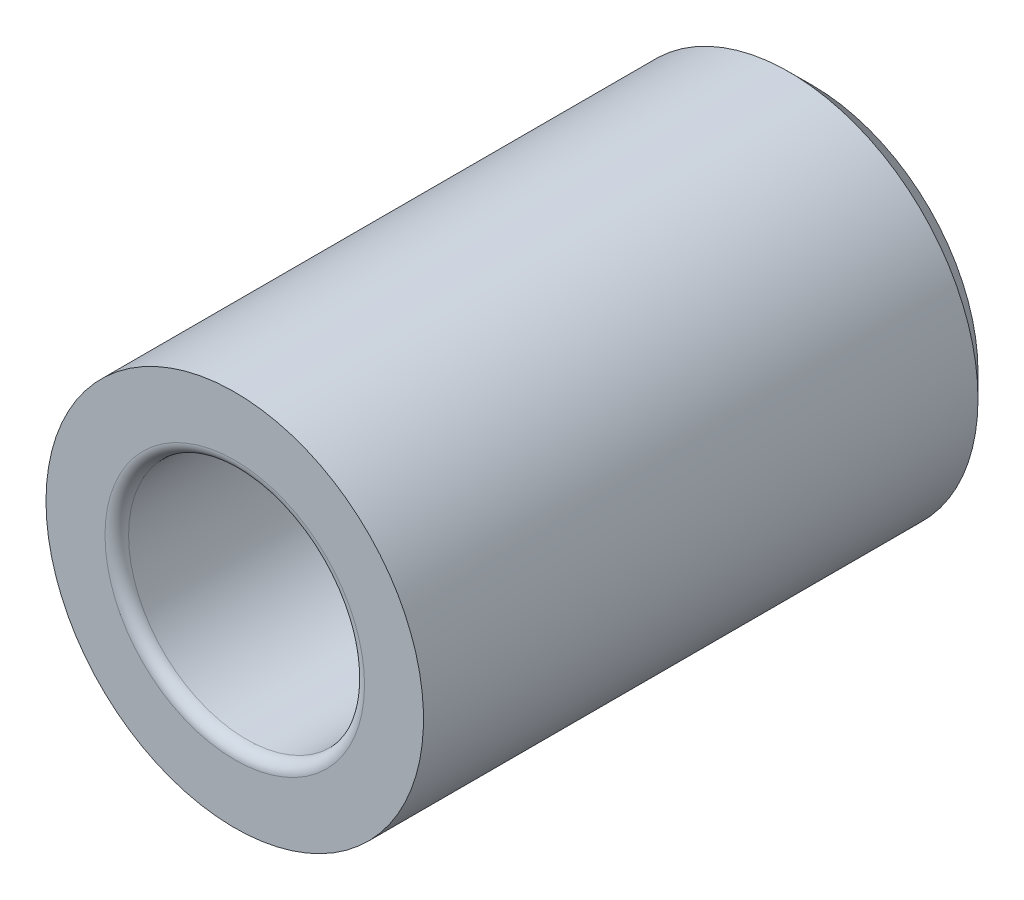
ISO-10303-21;
HEADER;
FILE_DESCRIPTION(('STEP AP214'),'2;1');
FILE_NAME('part.step','',(''),(''),'','','');
FILE_SCHEMA(('AUTOMOTIVE_DESIGN { 1 0 10303 214 1 1 1 1 }'));
ENDSEC;
DATA;
#1=APPLICATION_CONTEXT('core data for automotive mechanical design processes');
#2=APPLICATION_PROTOCOL_DEFINITION('international standard','automotive_design',2000,#1);
#3=PRODUCT_CONTEXT('',#1,'mechanical');
#4=PRODUCT('Part','Part','',(#3));
#5=PRODUCT_RELATED_PRODUCT_CATEGORY('part','',(#4));
#6=PRODUCT_DEFINITION_FORMATION('','',#4);
#7=PRODUCT_DEFINITION_CONTEXT('part definition',#1,'design');
#8=PRODUCT_DEFINITION('design','',#6,#7);
#9=PRODUCT_DEFINITION_SHAPE('','',#8);
#10=(LENGTH_UNIT() NAMED_UNIT(*) SI_UNIT(.MILLI.,.METRE.));
#11=(NAMED_UNIT(*) PLANE_ANGLE_UNIT() SI_UNIT($,.RADIAN.));
#12=(NAMED_UNIT(*) SI_UNIT($,.STERADIAN.) SOLID_ANGLE_UNIT());
#13=UNCERTAINTY_MEASURE_WITH_UNIT(LENGTH_MEASURE(1.E-05),#10,'distance_accuracy_value','');
#14=(GEOMETRIC_REPRESENTATION_CONTEXT(3) GLOBAL_UNCERTAINTY_ASSIGNED_CONTEXT((#13)) GLOBAL_UNIT_ASSIGNED_CONTEXT((#10,
#11,#12)) REPRESENTATION_CONTEXT('',''));
#15=CARTESIAN_POINT('',(0.,0.,0.));
#16=DIRECTION('',(0.,0.,1.));
#17=DIRECTION('',(1.,0.,0.));
#18=AXIS2_PLACEMENT_3D('',#15,#16,#17);
#19=CARTESIAN_POINT('',(0.,0.,-0.5));
#20=DIRECTION('',(0.,0.,-1.));
#21=DIRECTION('',(-1.,0.,0.));
#22=AXIS2_PLACEMENT_3D('',#19,#20,#21);
#23=PLANE('',#22);
#24=CARTESIAN_POINT('',(0.,0.,-0.5));
#25=DIRECTION('',(0.,0.,-1.));
#26=DIRECTION('',(-1.,0.,0.));
#27=AXIS2_PLACEMENT_3D('',#24,#25,#26);
#28=CIRCLE('',#27,5.5);
#29=CARTESIAN_POINT('',(-5.5,0.,-0.499999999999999));
#30=VERTEX_POINT('',#29);
#31=EDGE_CURVE('E50',#30,#30,#28,.T.);
#32=ORIENTED_EDGE('',*,*,#31,.T.);
#33=EDGE_LOOP('',(#32));
#34=FACE_BOUND('',#33,.T.);
#35=CARTESIAN_POINT('',(0.,0.,-0.5));
#36=DIRECTION('',(0.,0.,-1.));
#37=DIRECTION('',(-1.,0.,0.));
#38=AXIS2_PLACEMENT_3D('',#35,#36,#37);
#39=CIRCLE('',#38,8.);
#40=CARTESIAN_POINT('',(-8.,0.,-0.499999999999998));
#41=VERTEX_POINT('',#40);
#42=EDGE_CURVE('E69',#41,#41,#39,.T.);
#43=ORIENTED_EDGE('',*,*,#42,.F.);
#44=EDGE_LOOP('',(#43));
#45=FACE_BOUND('',#44,.T.);
#46=ADVANCED_FACE('F35',(#34,#45),#23,.F.);
#47=CARTESIAN_POINT('',(0.,0.,-0.5));
#48=DIRECTION('',(0.,0.,-1.));
#49=DIRECTION('',(-1.,0.,0.));
#50=AXIS2_PLACEMENT_3D('',#47,#48,#49);
#51=CYLINDRICAL_SURFACE('',#50,8.);
#52=CARTESIAN_POINT('',(0.,0.,-24.));
#53=DIRECTION('',(0.,0.,1.));
#54=DIRECTION('',(1.,0.,0.));
#55=AXIS2_PLACEMENT_3D('',#52,#53,#54);
#56=CIRCLE('',#55,8.);
#57=CARTESIAN_POINT('',(7.99999999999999,0.,-24.));
#58=VERTEX_POINT('',#57);
#59=EDGE_CURVE('E10',#58,#58,#56,.T.);
#60=ORIENTED_EDGE('',*,*,#59,.T.);
#61=EDGE_LOOP('',(#60));
#62=FACE_BOUND('',#61,.T.);
#63=ORIENTED_EDGE('',*,*,#42,.T.);
#64=EDGE_LOOP('',(#63));
#65=FACE_BOUND('',#64,.T.);
#66=ADVANCED_FACE('F82',(#62,#65),#51,.T.);
#67=CARTESIAN_POINT('',(0.,0.,-25.));
#68=DIRECTION('',(0.,0.,1.));
#69=DIRECTION('',(1.,0.,0.));
#70=AXIS2_PLACEMENT_3D('',#67,#68,#69);
#71=PLANE('',#70);
#72=CARTESIAN_POINT('',(0.,0.,-25.));
#73=DIRECTION('',(0.,0.,1.));
#74=DIRECTION('',(1.,0.,0.));
#75=AXIS2_PLACEMENT_3D('',#72,#73,#74);
#76=CIRCLE('',#75,6.99999999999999);
#77=CARTESIAN_POINT('',(6.99999999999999,0.,-25.));
#78=VERTEX_POINT('',#77);
#79=EDGE_CURVE('E42',#78,#78,#76,.F.);
#80=ORIENTED_EDGE('',*,*,#79,.T.);
#81=EDGE_LOOP('',(#80));
#82=FACE_BOUND('',#81,.T.);
#83=CARTESIAN_POINT('',(0.,0.,-25.));
#84=DIRECTION('',(0.,0.,-1.));
#85=DIRECTION('',(-1.,0.,0.));
#86=AXIS2_PLACEMENT_3D('',#83,#84,#85);
#87=CIRCLE('',#86,2.1);
#88=CARTESIAN_POINT('',(-2.1,0.,-25.));
#89=VERTEX_POINT('',#88);
#90=EDGE_CURVE('E60',#89,#89,#87,.T.);
#91=ORIENTED_EDGE('',*,*,#90,.F.);
#92=EDGE_LOOP('',(#91));
#93=FACE_BOUND('',#92,.T.);
#94=ADVANCED_FACE('F79',(#82,#93),#71,.F.);
#95=CARTESIAN_POINT('',(0.,0.,-0.5));
#96=DIRECTION('',(0.,0.,-1.));
#97=DIRECTION('',(-1.,0.,0.));
#98=AXIS2_PLACEMENT_3D('',#95,#96,#97);
#99=CYLINDRICAL_SURFACE('',#98,6.25);
#100=CARTESIAN_POINT('',(0.,0.,-12.75));
#101=DIRECTION('',(0.,0.,-1.));
#102=DIRECTION('',(-1.,0.,0.));
#103=AXIS2_PLACEMENT_3D('',#100,#101,#102);
#104=CIRCLE('',#103,6.25);
#105=CARTESIAN_POINT('',(-6.25,0.,-12.75));
#106=VERTEX_POINT('',#105);
#107=EDGE_CURVE('E63',#106,#106,#104,.F.);
#108=ORIENTED_EDGE('',*,*,#107,.T.);
#109=EDGE_LOOP('',(#108));
#110=FACE_BOUND('',#109,.T.);
#111=CARTESIAN_POINT('',(0.,0.,-15.75));
#112=DIRECTION('',(0.,0.,1.));
#113=DIRECTION('',(1.,0.,0.));
#114=AXIS2_PLACEMENT_3D('',#111,#112,#113);
#115=CIRCLE('',#114,6.25);
#116=CARTESIAN_POINT('',(6.25,0.,-15.75));
#117=VERTEX_POINT('',#116);
#118=EDGE_CURVE('E66',#117,#117,#115,.F.);
#119=ORIENTED_EDGE('',*,*,#118,.T.);
#120=EDGE_LOOP('',(#119));
#121=FACE_BOUND('',#120,.T.);
#122=ADVANCED_FACE('F81',(#110,#121),#99,.F.);
#123=CARTESIAN_POINT('',(0.,0.,-17.));
#124=DIRECTION('',(0.,0.,1.));
#125=DIRECTION('',(1.,0.,0.));
#126=AXIS2_PLACEMENT_3D('',#123,#124,#125);
#127=PLANE('',#126);
#128=CARTESIAN_POINT('',(0.,0.,-17.));
#129=DIRECTION('',(0.,0.,1.));
#130=DIRECTION('',(1.,0.,0.));
#131=AXIS2_PLACEMENT_3D('',#128,#129,#130);
#132=CIRCLE('',#131,2.1);
#133=CARTESIAN_POINT('',(2.09999999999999,0.,-17.));
#134=VERTEX_POINT('',#133);
#135=EDGE_CURVE('E56',#134,#134,#132,.T.);
#136=ORIENTED_EDGE('',*,*,#135,.F.);
#137=EDGE_LOOP('',(#136));
#138=FACE_BOUND('',#137,.T.);
#139=CARTESIAN_POINT('',(0.,0.,-17.));
#140=DIRECTION('',(0.,0.,1.));
#141=DIRECTION('',(1.,0.,0.));
#142=AXIS2_PLACEMENT_3D('',#139,#140,#141);
#143=CIRCLE('',#142,5.);
#144=CARTESIAN_POINT('',(5.,0.,-17.));
#145=VERTEX_POINT('',#144);
#146=EDGE_CURVE('E55',#145,#145,#143,.T.);
#147=ORIENTED_EDGE('',*,*,#146,.T.);
#148=EDGE_LOOP('',(#147));
#149=FACE_BOUND('',#148,.T.);
#150=ADVANCED_FACE('F88',(#138,#149),#127,.T.);
#151=CARTESIAN_POINT('',(0.,0.,-0.5));
#152=DIRECTION('',(0.,0.,-1.));
#153=DIRECTION('',(-1.,0.,0.));
#154=AXIS2_PLACEMENT_3D('',#151,#152,#153);
#155=CYLINDRICAL_SURFACE('',#154,5.);
#156=CARTESIAN_POINT('',(0.,0.,-1.));
#157=DIRECTION('',(0.,0.,-1.));
#158=DIRECTION('',(-1.,0.,0.));
#159=AXIS2_PLACEMENT_3D('',#156,#157,#158);
#160=CIRCLE('',#159,5.);
#161=CARTESIAN_POINT('',(-5.,0.,-0.999999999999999));
#162=VERTEX_POINT('',#161);
#163=EDGE_CURVE('E46',#162,#162,#160,.F.);
#164=ORIENTED_EDGE('',*,*,#163,.T.);
#165=EDGE_LOOP('',(#164));
#166=FACE_BOUND('',#165,.T.);
#167=CARTESIAN_POINT('',(0.,0.,-11.5));
#168=DIRECTION('',(0.,0.,-1.));
#169=DIRECTION('',(-1.,0.,0.));
#170=AXIS2_PLACEMENT_3D('',#167,#168,#169);
#171=CIRCLE('',#170,5.);
#172=CARTESIAN_POINT('',(-5.,0.,-11.5));
#173=VERTEX_POINT('',#172);
#174=EDGE_CURVE('E59',#173,#173,#171,.T.);
#175=ORIENTED_EDGE('',*,*,#174,.T.);
#176=EDGE_LOOP('',(#175));
#177=FACE_BOUND('',#176,.T.);
#178=ADVANCED_FACE('F103',(#166,#177),#155,.F.);
#179=CARTESIAN_POINT('',(0.,0.,-12.75));
#180=DIRECTION('',(0.,0.,-1.));
#181=DIRECTION('',(-1.,0.,0.));
#182=AXIS2_PLACEMENT_3D('',#179,#180,#181);
#183=TOROIDAL_SURFACE('',#182,5.,1.25);
#184=ORIENTED_EDGE('',*,*,#107,.F.);
#185=EDGE_LOOP('',(#184));
#186=FACE_BOUND('',#185,.T.);
#187=ORIENTED_EDGE('',*,*,#174,.F.);
#188=EDGE_LOOP('',(#187));
#189=FACE_BOUND('',#188,.T.);
#190=ADVANCED_FACE('F99',(#186,#189),#183,.F.);
#191=CARTESIAN_POINT('',(0.,0.,-15.75));
#192=DIRECTION('',(0.,0.,1.));
#193=DIRECTION('',(1.,0.,0.));
#194=AXIS2_PLACEMENT_3D('',#191,#192,#193);
#195=TOROIDAL_SURFACE('',#194,5.,1.25);
#196=ORIENTED_EDGE('',*,*,#146,.F.);
#197=EDGE_LOOP('',(#196));
#198=FACE_BOUND('',#197,.T.);
#199=ORIENTED_EDGE('',*,*,#118,.F.);
#200=EDGE_LOOP('',(#199));
#201=FACE_BOUND('',#200,.T.);
#202=ADVANCED_FACE('F102',(#198,#201),#195,.F.);
#203=CARTESIAN_POINT('',(0.,0.,-25.));
#204=DIRECTION('',(0.,0.,-1.));
#205=DIRECTION('',(-1.,0.,0.));
#206=AXIS2_PLACEMENT_3D('',#203,#204,#205);
#207=CYLINDRICAL_SURFACE('',#206,2.1);
#208=ORIENTED_EDGE('',*,*,#135,.T.);
#209=EDGE_LOOP('',(#208));
#210=FACE_BOUND('',#209,.T.);
#211=ORIENTED_EDGE('',*,*,#90,.T.);
#212=EDGE_LOOP('',(#211));
#213=FACE_BOUND('',#212,.T.);
#214=ADVANCED_FACE('F77',(#210,#213),#207,.F.);
#215=CARTESIAN_POINT('',(0.,0.,-1.));
#216=DIRECTION('',(0.,0.,-1.));
#217=DIRECTION('',(-1.,0.,0.));
#218=AXIS2_PLACEMENT_3D('',#215,#216,#217);
#219=TOROIDAL_SURFACE('',#218,5.5,0.5);
#220=ORIENTED_EDGE('',*,*,#163,.F.);
#221=EDGE_LOOP('',(#220));
#222=FACE_BOUND('',#221,.T.);
#223=ORIENTED_EDGE('',*,*,#31,.F.);
#224=EDGE_LOOP('',(#223));
#225=FACE_BOUND('',#224,.T.);
#226=ADVANCED_FACE('F107',(#222,#225),#219,.T.);
#227=CARTESIAN_POINT('',(0.,0.,-25.));
#228=DIRECTION('',(0.,0.,1.));
#229=DIRECTION('',(1.,0.,0.));
#230=AXIS2_PLACEMENT_3D('',#227,#228,#229);
#231=CONICAL_SURFACE('',#230,6.99999999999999,0.785398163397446);
#232=ORIENTED_EDGE('',*,*,#59,.F.);
#233=EDGE_LOOP('',(#232));
#234=FACE_BOUND('',#233,.T.);
#235=ORIENTED_EDGE('',*,*,#79,.F.);
#236=EDGE_LOOP('',(#235));
#237=FACE_BOUND('',#236,.T.);
#238=ADVANCED_FACE('F37',(#234,#237),#231,.T.);
#239=CLOSED_SHELL('',(#46,#66,#94,#122,#150,#178,#190,#202,#214,#226,#238));
#240=MANIFOLD_SOLID_BREP('B2',#239);
#241=ADVANCED_BREP_SHAPE_REPRESENTATION('',(#18,#240),#14);
#242=SHAPE_DEFINITION_REPRESENTATION(#9,#241);
ENDSEC;
END-ISO-10303-21;
